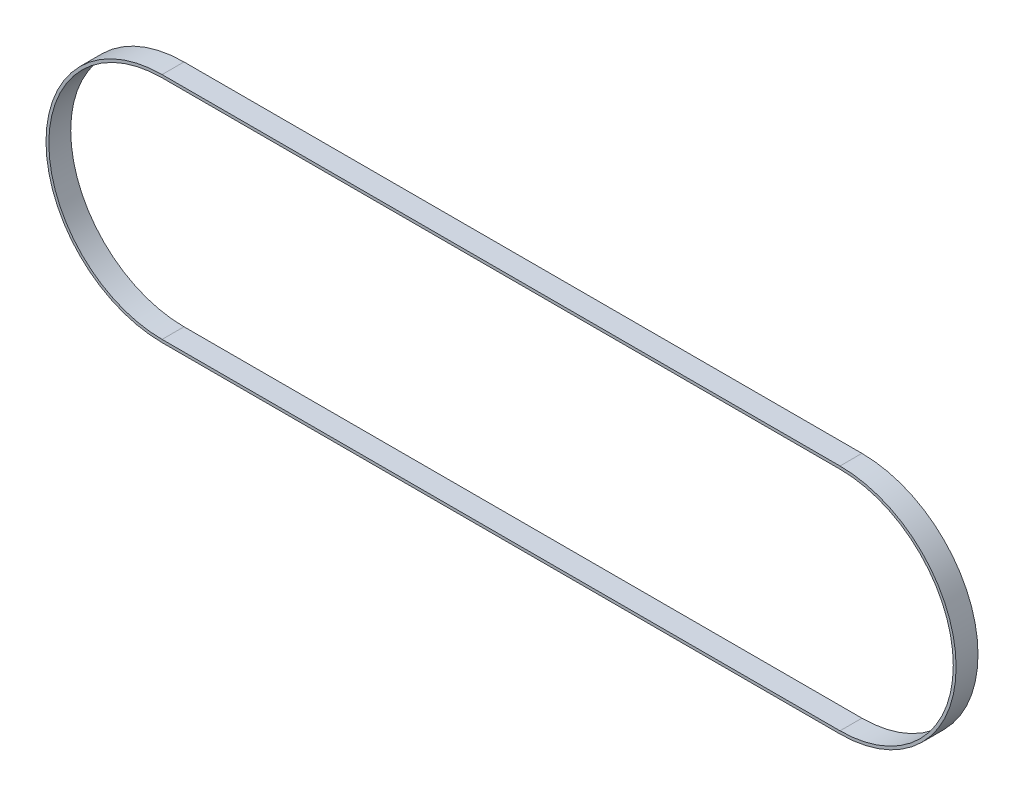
ISO-10303-21;
HEADER;
FILE_DESCRIPTION(('STEP AP214'),'2;1');
FILE_NAME('part.step','',(''),(''),'','','');
FILE_SCHEMA(('AUTOMOTIVE_DESIGN { 1 0 10303 214 1 1 1 1 }'));
ENDSEC;
DATA;
#1=APPLICATION_CONTEXT('core data for automotive mechanical design processes');
#2=APPLICATION_PROTOCOL_DEFINITION('international standard','automotive_design',2000,#1);
#3=PRODUCT_CONTEXT('',#1,'mechanical');
#4=PRODUCT('Part','Part','',(#3));
#5=PRODUCT_RELATED_PRODUCT_CATEGORY('part','',(#4));
#6=PRODUCT_DEFINITION_FORMATION('','',#4);
#7=PRODUCT_DEFINITION_CONTEXT('part definition',#1,'design');
#8=PRODUCT_DEFINITION('design','',#6,#7);
#9=PRODUCT_DEFINITION_SHAPE('','',#8);
#10=(LENGTH_UNIT() NAMED_UNIT(*) SI_UNIT(.MILLI.,.METRE.));
#11=(NAMED_UNIT(*) PLANE_ANGLE_UNIT() SI_UNIT($,.RADIAN.));
#12=(NAMED_UNIT(*) SI_UNIT($,.STERADIAN.) SOLID_ANGLE_UNIT());
#13=UNCERTAINTY_MEASURE_WITH_UNIT(LENGTH_MEASURE(1.E-05),#10,'distance_accuracy_value','');
#14=(GEOMETRIC_REPRESENTATION_CONTEXT(3) GLOBAL_UNCERTAINTY_ASSIGNED_CONTEXT((#13)) GLOBAL_UNIT_ASSIGNED_CONTEXT((#10,
#11,#12)) REPRESENTATION_CONTEXT('',''));
#15=CARTESIAN_POINT('',(0.,0.,0.));
#16=DIRECTION('',(0.,0.,1.));
#17=DIRECTION('',(1.,0.,0.));
#18=AXIS2_PLACEMENT_3D('',#15,#16,#17);
#19=CARTESIAN_POINT('',(0.,0.,3.875));
#20=DIRECTION('',(0.,0.,-1.));
#21=DIRECTION('',(-1.,0.,0.));
#22=AXIS2_PLACEMENT_3D('',#19,#20,#21);
#23=PLANE('',#22);
#24=CARTESIAN_POINT('',(0.,0.,3.875));
#25=DIRECTION('',(0.,0.,-1.));
#26=DIRECTION('',(-1.,0.,0.));
#27=AXIS2_PLACEMENT_3D('',#24,#25,#26);
#28=CIRCLE('',#27,41.095);
#29=CARTESIAN_POINT('',(0.,41.095,3.875));
#30=VERTEX_POINT('',#29);
#31=CARTESIAN_POINT('',(0.,-41.095,3.875));
#32=VERTEX_POINT('',#31);
#33=EDGE_CURVE('E158',#30,#32,#28,.F.);
#34=ORIENTED_EDGE('',*,*,#33,.T.);
#35=DIRECTION('',(1.,0.,0.));
#36=VECTOR('',#35,1.);
#37=CARTESIAN_POINT('',(0.,-41.095,3.875));
#38=LINE('',#37,#36);
#39=CARTESIAN_POINT('',(240.,-41.095,3.875));
#40=VERTEX_POINT('',#39);
#41=EDGE_CURVE('E161',#32,#40,#38,.T.);
#42=ORIENTED_EDGE('',*,*,#41,.T.);
#43=CARTESIAN_POINT('',(240.,0.,3.875));
#44=DIRECTION('',(0.,0.,-1.));
#45=DIRECTION('',(-1.,0.,0.));
#46=AXIS2_PLACEMENT_3D('',#43,#44,#45);
#47=CIRCLE('',#46,41.095);
#48=CARTESIAN_POINT('',(240.,41.095,3.875));
#49=VERTEX_POINT('',#48);
#50=EDGE_CURVE('E164',#40,#49,#47,.F.);
#51=ORIENTED_EDGE('',*,*,#50,.T.);
#52=DIRECTION('',(-1.,0.,0.));
#53=VECTOR('',#52,1.);
#54=CARTESIAN_POINT('',(0.,41.095,3.875));
#55=LINE('',#54,#53);
#56=EDGE_CURVE('E166',#49,#30,#55,.T.);
#57=ORIENTED_EDGE('',*,*,#56,.T.);
#58=EDGE_LOOP('',(#34,#42,#51,#57));
#59=FACE_BOUND('',#58,.T.);
#60=CARTESIAN_POINT('',(0.,0.,3.875));
#61=DIRECTION('',(0.,0.,-1.));
#62=DIRECTION('',(-1.,0.,0.));
#63=AXIS2_PLACEMENT_3D('',#60,#61,#62);
#64=CIRCLE('',#63,40.095);
#65=CARTESIAN_POINT('',(0.,40.095,3.875));
#66=VERTEX_POINT('',#65);
#67=CARTESIAN_POINT('',(0.,-40.095,3.875));
#68=VERTEX_POINT('',#67);
#69=EDGE_CURVE('E122',#66,#68,#64,.F.);
#70=ORIENTED_EDGE('',*,*,#69,.F.);
#71=DIRECTION('',(-1.,0.,0.));
#72=VECTOR('',#71,1.);
#73=CARTESIAN_POINT('',(0.,40.095,3.875));
#74=LINE('',#73,#72);
#75=CARTESIAN_POINT('',(240.,40.095,3.875));
#76=VERTEX_POINT('',#75);
#77=EDGE_CURVE('E144',#76,#66,#74,.T.);
#78=ORIENTED_EDGE('',*,*,#77,.F.);
#79=CARTESIAN_POINT('',(240.,0.,3.875));
#80=DIRECTION('',(0.,0.,-1.));
#81=DIRECTION('',(-1.,0.,0.));
#82=AXIS2_PLACEMENT_3D('',#79,#80,#81);
#83=CIRCLE('',#82,40.095);
#84=CARTESIAN_POINT('',(240.,-40.095,3.875));
#85=VERTEX_POINT('',#84);
#86=EDGE_CURVE('E142',#85,#76,#83,.F.);
#87=ORIENTED_EDGE('',*,*,#86,.F.);
#88=DIRECTION('',(1.,0.,0.));
#89=VECTOR('',#88,1.);
#90=CARTESIAN_POINT('',(0.,-40.095,3.875));
#91=LINE('',#90,#89);
#92=EDGE_CURVE('E130',#68,#85,#91,.T.);
#93=ORIENTED_EDGE('',*,*,#92,.F.);
#94=EDGE_LOOP('',(#70,#78,#87,#93));
#95=FACE_BOUND('',#94,.T.);
#96=ADVANCED_FACE('F57',(#59,#95),#23,.F.);
#97=CARTESIAN_POINT('',(0.,0.,-3.875));
#98=DIRECTION('',(0.,0.,-1.));
#99=DIRECTION('',(-1.,0.,0.));
#100=AXIS2_PLACEMENT_3D('',#97,#98,#99);
#101=PLANE('',#100);
#102=CARTESIAN_POINT('',(0.,0.,-3.875));
#103=DIRECTION('',(0.,0.,-1.));
#104=DIRECTION('',(-1.,0.,0.));
#105=AXIS2_PLACEMENT_3D('',#102,#103,#104);
#106=CIRCLE('',#105,41.095);
#107=CARTESIAN_POINT('',(0.,41.095,-3.875));
#108=VERTEX_POINT('',#107);
#109=CARTESIAN_POINT('',(0.,-41.095,-3.875));
#110=VERTEX_POINT('',#109);
#111=EDGE_CURVE('E138',#108,#110,#106,.F.);
#112=ORIENTED_EDGE('',*,*,#111,.F.);
#113=DIRECTION('',(-1.,0.,0.));
#114=VECTOR('',#113,1.);
#115=CARTESIAN_POINT('',(0.,41.095,-3.875));
#116=LINE('',#115,#114);
#117=CARTESIAN_POINT('',(240.,41.095,-3.875));
#118=VERTEX_POINT('',#117);
#119=EDGE_CURVE('E162',#118,#108,#116,.T.);
#120=ORIENTED_EDGE('',*,*,#119,.F.);
#121=CARTESIAN_POINT('',(240.,0.,-3.875));
#122=DIRECTION('',(0.,0.,-1.));
#123=DIRECTION('',(-1.,0.,0.));
#124=AXIS2_PLACEMENT_3D('',#121,#122,#123);
#125=CIRCLE('',#124,41.095);
#126=CARTESIAN_POINT('',(240.,-41.095,-3.875));
#127=VERTEX_POINT('',#126);
#128=EDGE_CURVE('E173',#127,#118,#125,.F.);
#129=ORIENTED_EDGE('',*,*,#128,.F.);
#130=DIRECTION('',(1.,0.,0.));
#131=VECTOR('',#130,1.);
#132=CARTESIAN_POINT('',(0.,-41.095,-3.875));
#133=LINE('',#132,#131);
#134=EDGE_CURVE('E171',#110,#127,#133,.T.);
#135=ORIENTED_EDGE('',*,*,#134,.F.);
#136=EDGE_LOOP('',(#112,#120,#129,#135));
#137=FACE_BOUND('',#136,.T.);
#138=DIRECTION('',(-1.,0.,0.));
#139=VECTOR('',#138,1.);
#140=CARTESIAN_POINT('',(0.,40.095,-3.875));
#141=LINE('',#140,#139);
#142=CARTESIAN_POINT('',(240.,40.095,-3.875));
#143=VERTEX_POINT('',#142);
#144=CARTESIAN_POINT('',(0.,40.095,-3.875));
#145=VERTEX_POINT('',#144);
#146=EDGE_CURVE('E131',#143,#145,#141,.T.);
#147=ORIENTED_EDGE('',*,*,#146,.T.);
#148=CARTESIAN_POINT('',(0.,0.,-3.875));
#149=DIRECTION('',(0.,0.,-1.));
#150=DIRECTION('',(-1.,0.,0.));
#151=AXIS2_PLACEMENT_3D('',#148,#149,#150);
#152=CIRCLE('',#151,40.095);
#153=CARTESIAN_POINT('',(0.,-40.095,-3.875));
#154=VERTEX_POINT('',#153);
#155=EDGE_CURVE('E80',#145,#154,#152,.F.);
#156=ORIENTED_EDGE('',*,*,#155,.T.);
#157=DIRECTION('',(1.,0.,0.));
#158=VECTOR('',#157,1.);
#159=CARTESIAN_POINT('',(0.,-40.095,-3.875));
#160=LINE('',#159,#158);
#161=CARTESIAN_POINT('',(240.,-40.095,-3.875));
#162=VERTEX_POINT('',#161);
#163=EDGE_CURVE('E137',#154,#162,#160,.T.);
#164=ORIENTED_EDGE('',*,*,#163,.T.);
#165=CARTESIAN_POINT('',(240.,0.,-3.875));
#166=DIRECTION('',(0.,0.,-1.));
#167=DIRECTION('',(-1.,0.,0.));
#168=AXIS2_PLACEMENT_3D('',#165,#166,#167);
#169=CIRCLE('',#168,40.095);
#170=EDGE_CURVE('E150',#162,#143,#169,.F.);
#171=ORIENTED_EDGE('',*,*,#170,.T.);
#172=EDGE_LOOP('',(#147,#156,#164,#171));
#173=FACE_BOUND('',#172,.T.);
#174=ADVANCED_FACE('F191',(#137,#173),#101,.T.);
#175=CARTESIAN_POINT('',(0.,0.,3.875));
#176=DIRECTION('',(0.,0.,-1.));
#177=DIRECTION('',(-1.,0.,0.));
#178=AXIS2_PLACEMENT_3D('',#175,#176,#177);
#179=CYLINDRICAL_SURFACE('',#178,41.095);
#180=ORIENTED_EDGE('',*,*,#111,.T.);
#181=DIRECTION('',(0.,0.,-1.));
#182=VECTOR('',#181,1.);
#183=CARTESIAN_POINT('',(0.,-41.095,3.875));
#184=LINE('',#183,#182);
#185=EDGE_CURVE('E12',#32,#110,#184,.T.);
#186=ORIENTED_EDGE('',*,*,#185,.F.);
#187=ORIENTED_EDGE('',*,*,#33,.F.);
#188=DIRECTION('',(0.,0.,-1.));
#189=VECTOR('',#188,1.);
#190=CARTESIAN_POINT('',(0.,41.095,3.875));
#191=LINE('',#190,#189);
#192=EDGE_CURVE('E168',#30,#108,#191,.T.);
#193=ORIENTED_EDGE('',*,*,#192,.T.);
#194=EDGE_LOOP('',(#180,#186,#187,#193));
#195=FACE_BOUND('',#194,.T.);
#196=ADVANCED_FACE('F59',(#195),#179,.T.);
#197=CARTESIAN_POINT('',(0.,-41.095,3.875));
#198=DIRECTION('',(0.,1.,0.));
#199=DIRECTION('',(-1.,0.,0.));
#200=AXIS2_PLACEMENT_3D('',#197,#198,#199);
#201=PLANE('',#200);
#202=ORIENTED_EDGE('',*,*,#134,.T.);
#203=DIRECTION('',(0.,0.,-1.));
#204=VECTOR('',#203,1.);
#205=CARTESIAN_POINT('',(240.,-41.095,3.875));
#206=LINE('',#205,#204);
#207=EDGE_CURVE('E65',#40,#127,#206,.T.);
#208=ORIENTED_EDGE('',*,*,#207,.F.);
#209=ORIENTED_EDGE('',*,*,#41,.F.);
#210=ORIENTED_EDGE('',*,*,#185,.T.);
#211=EDGE_LOOP('',(#202,#208,#209,#210));
#212=FACE_BOUND('',#211,.T.);
#213=ADVANCED_FACE('F201',(#212),#201,.F.);
#214=CARTESIAN_POINT('',(240.,0.,3.875));
#215=DIRECTION('',(0.,0.,-1.));
#216=DIRECTION('',(-1.,0.,0.));
#217=AXIS2_PLACEMENT_3D('',#214,#215,#216);
#218=CYLINDRICAL_SURFACE('',#217,41.095);
#219=ORIENTED_EDGE('',*,*,#128,.T.);
#220=DIRECTION('',(0.,0.,-1.));
#221=VECTOR('',#220,1.);
#222=CARTESIAN_POINT('',(240.,41.095,3.875));
#223=LINE('',#222,#221);
#224=EDGE_CURVE('E178',#49,#118,#223,.T.);
#225=ORIENTED_EDGE('',*,*,#224,.F.);
#226=ORIENTED_EDGE('',*,*,#50,.F.);
#227=ORIENTED_EDGE('',*,*,#207,.T.);
#228=EDGE_LOOP('',(#219,#225,#226,#227));
#229=FACE_BOUND('',#228,.T.);
#230=ADVANCED_FACE('F185',(#229),#218,.T.);
#231=CARTESIAN_POINT('',(0.,41.095,3.875));
#232=DIRECTION('',(0.,-1.,0.));
#233=DIRECTION('',(1.,0.,0.));
#234=AXIS2_PLACEMENT_3D('',#231,#232,#233);
#235=PLANE('',#234);
#236=ORIENTED_EDGE('',*,*,#119,.T.);
#237=ORIENTED_EDGE('',*,*,#192,.F.);
#238=ORIENTED_EDGE('',*,*,#56,.F.);
#239=ORIENTED_EDGE('',*,*,#224,.T.);
#240=EDGE_LOOP('',(#236,#237,#238,#239));
#241=FACE_BOUND('',#240,.T.);
#242=ADVANCED_FACE('F195',(#241),#235,.F.);
#243=CARTESIAN_POINT('',(0.,0.,3.875));
#244=DIRECTION('',(0.,0.,-1.));
#245=DIRECTION('',(-1.,0.,0.));
#246=AXIS2_PLACEMENT_3D('',#243,#244,#245);
#247=CYLINDRICAL_SURFACE('',#246,40.095);
#248=ORIENTED_EDGE('',*,*,#155,.F.);
#249=DIRECTION('',(0.,0.,-1.));
#250=VECTOR('',#249,1.);
#251=CARTESIAN_POINT('',(0.,40.095,3.875));
#252=LINE('',#251,#250);
#253=EDGE_CURVE('E126',#66,#145,#252,.T.);
#254=ORIENTED_EDGE('',*,*,#253,.F.);
#255=ORIENTED_EDGE('',*,*,#69,.T.);
#256=DIRECTION('',(0.,0.,-1.));
#257=VECTOR('',#256,1.);
#258=CARTESIAN_POINT('',(0.,-40.095,3.875));
#259=LINE('',#258,#257);
#260=EDGE_CURVE('E125',#68,#154,#259,.T.);
#261=ORIENTED_EDGE('',*,*,#260,.T.);
#262=EDGE_LOOP('',(#248,#254,#255,#261));
#263=FACE_BOUND('',#262,.T.);
#264=ADVANCED_FACE('F124',(#263),#247,.F.);
#265=CARTESIAN_POINT('',(0.,-40.095,3.875));
#266=DIRECTION('',(0.,1.,0.));
#267=DIRECTION('',(-1.,0.,0.));
#268=AXIS2_PLACEMENT_3D('',#265,#266,#267);
#269=PLANE('',#268);
#270=ORIENTED_EDGE('',*,*,#163,.F.);
#271=ORIENTED_EDGE('',*,*,#260,.F.);
#272=ORIENTED_EDGE('',*,*,#92,.T.);
#273=DIRECTION('',(0.,0.,-1.));
#274=VECTOR('',#273,1.);
#275=CARTESIAN_POINT('',(240.,-40.095,3.875));
#276=LINE('',#275,#274);
#277=EDGE_CURVE('E139',#85,#162,#276,.T.);
#278=ORIENTED_EDGE('',*,*,#277,.T.);
#279=EDGE_LOOP('',(#270,#271,#272,#278));
#280=FACE_BOUND('',#279,.T.);
#281=ADVANCED_FACE('F134',(#280),#269,.T.);
#282=CARTESIAN_POINT('',(240.,0.,3.875));
#283=DIRECTION('',(0.,0.,-1.));
#284=DIRECTION('',(-1.,0.,0.));
#285=AXIS2_PLACEMENT_3D('',#282,#283,#284);
#286=CYLINDRICAL_SURFACE('',#285,40.095);
#287=ORIENTED_EDGE('',*,*,#170,.F.);
#288=ORIENTED_EDGE('',*,*,#277,.F.);
#289=ORIENTED_EDGE('',*,*,#86,.T.);
#290=DIRECTION('',(0.,0.,-1.));
#291=VECTOR('',#290,1.);
#292=CARTESIAN_POINT('',(240.,40.095,3.875));
#293=LINE('',#292,#291);
#294=EDGE_CURVE('E72',#76,#143,#293,.T.);
#295=ORIENTED_EDGE('',*,*,#294,.T.);
#296=EDGE_LOOP('',(#287,#288,#289,#295));
#297=FACE_BOUND('',#296,.T.);
#298=ADVANCED_FACE('F224',(#297),#286,.F.);
#299=CARTESIAN_POINT('',(0.,40.095,3.875));
#300=DIRECTION('',(0.,-1.,0.));
#301=DIRECTION('',(1.,0.,0.));
#302=AXIS2_PLACEMENT_3D('',#299,#300,#301);
#303=PLANE('',#302);
#304=ORIENTED_EDGE('',*,*,#146,.F.);
#305=ORIENTED_EDGE('',*,*,#294,.F.);
#306=ORIENTED_EDGE('',*,*,#77,.T.);
#307=ORIENTED_EDGE('',*,*,#253,.T.);
#308=EDGE_LOOP('',(#304,#305,#306,#307));
#309=FACE_BOUND('',#308,.T.);
#310=ADVANCED_FACE('F228',(#309),#303,.T.);
#311=CLOSED_SHELL('',(#96,#174,#196,#213,#230,#242,#264,#281,#298,#310));
#312=MANIFOLD_SOLID_BREP('B2',#311);
#313=ADVANCED_BREP_SHAPE_REPRESENTATION('',(#18,#312),#14);
#314=SHAPE_DEFINITION_REPRESENTATION(#9,#313);
ENDSEC;
END-ISO-10303-21;
